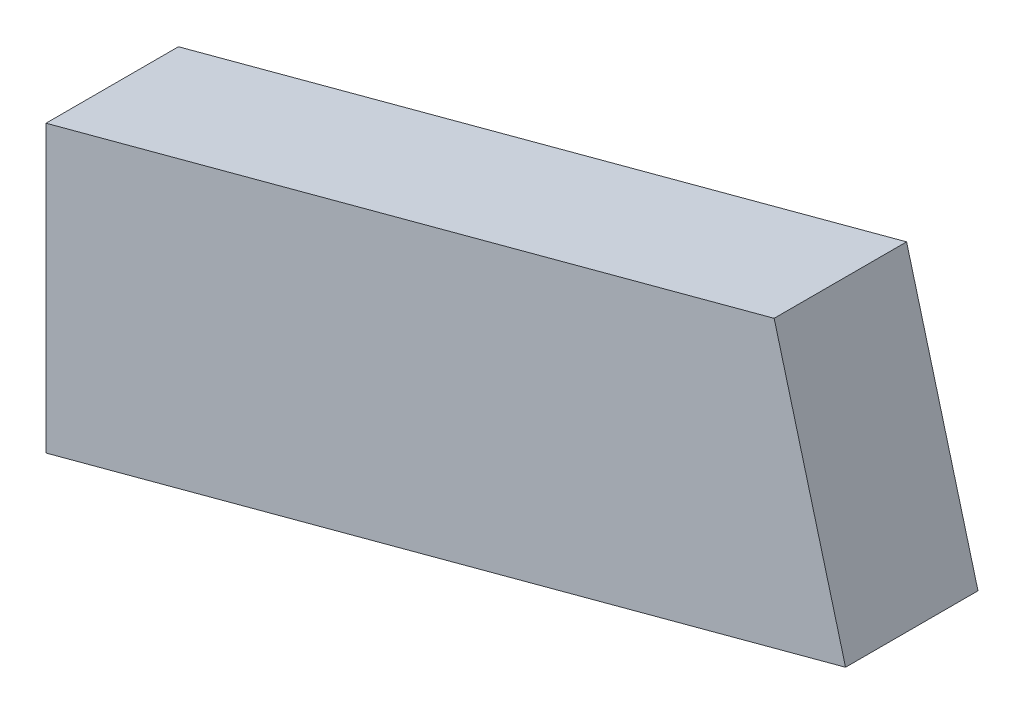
from build123d import *

# Parameters (mm, degrees)
BOSS_EXTRUDE1_DEPTH = 12


with BuildPart() as part:
    # Sketch1 → Boss-Extrude1 (new body)
    with BuildSketch(Plane.XY):
        Polygon((0, 0), (0, 25.88190451), (65.973960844, 43.55957404), (72.444436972, 19.411428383), align=None)
    extrude(amount=BOSS_EXTRUDE1_DEPTH)


solid = part.part
